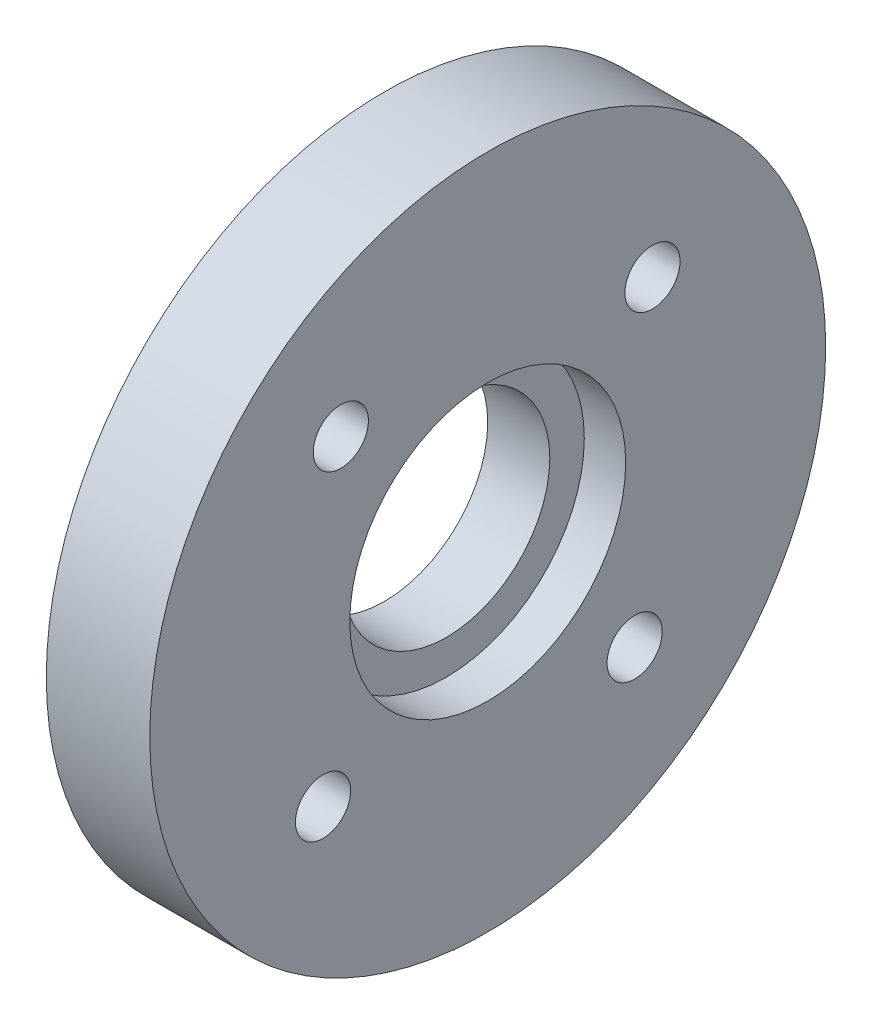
ISO-10303-21;
HEADER;
FILE_DESCRIPTION(('STEP AP214'),'2;1');
FILE_NAME('part.step','',(''),(''),'','','');
FILE_SCHEMA(('AUTOMOTIVE_DESIGN { 1 0 10303 214 1 1 1 1 }'));
ENDSEC;
DATA;
#1=APPLICATION_CONTEXT('core data for automotive mechanical design processes');
#2=APPLICATION_PROTOCOL_DEFINITION('international standard','automotive_design',2000,#1);
#3=PRODUCT_CONTEXT('',#1,'mechanical');
#4=PRODUCT('Part','Part','',(#3));
#5=PRODUCT_RELATED_PRODUCT_CATEGORY('part','',(#4));
#6=PRODUCT_DEFINITION_FORMATION('','',#4);
#7=PRODUCT_DEFINITION_CONTEXT('part definition',#1,'design');
#8=PRODUCT_DEFINITION('design','',#6,#7);
#9=PRODUCT_DEFINITION_SHAPE('','',#8);
#10=(LENGTH_UNIT() NAMED_UNIT(*) SI_UNIT(.MILLI.,.METRE.));
#11=(NAMED_UNIT(*) PLANE_ANGLE_UNIT() SI_UNIT($,.RADIAN.));
#12=(NAMED_UNIT(*) SI_UNIT($,.STERADIAN.) SOLID_ANGLE_UNIT());
#13=UNCERTAINTY_MEASURE_WITH_UNIT(LENGTH_MEASURE(1.E-05),#10,'distance_accuracy_value','');
#14=(GEOMETRIC_REPRESENTATION_CONTEXT(3) GLOBAL_UNCERTAINTY_ASSIGNED_CONTEXT((#13)) GLOBAL_UNIT_ASSIGNED_CONTEXT((#10,
#11,#12)) REPRESENTATION_CONTEXT('',''));
#15=CARTESIAN_POINT('',(0.,0.,0.));
#16=DIRECTION('',(0.,0.,1.));
#17=DIRECTION('',(1.,0.,0.));
#18=AXIS2_PLACEMENT_3D('',#15,#16,#17);
#19=CARTESIAN_POINT('',(0.,15.,0.));
#20=DIRECTION('',(1.,0.,0.));
#21=DIRECTION('',(0.,0.,-1.));
#22=AXIS2_PLACEMENT_3D('',#19,#20,#21);
#23=PLANE('',#22);
#24=CARTESIAN_POINT('',(0.,23.8825487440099,21.2984474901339));
#25=DIRECTION('',(1.,0.,0.));
#26=DIRECTION('',(0.,0.,-1.));
#27=AXIS2_PLACEMENT_3D('',#24,#25,#26);
#28=CIRCLE('',#27,4.);
#29=CARTESIAN_POINT('',(0.,23.8825487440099,17.2984474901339));
#30=VERTEX_POINT('',#29);
#31=EDGE_CURVE('E72',#30,#30,#28,.T.);
#32=ORIENTED_EDGE('',*,*,#31,.T.);
#33=EDGE_LOOP('',(#32));
#34=FACE_BOUND('',#33,.T.);
#35=CARTESIAN_POINT('',(0.,21.2984474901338,-23.88254874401));
#36=DIRECTION('',(1.,0.,0.));
#37=DIRECTION('',(0.,0.,-1.));
#38=AXIS2_PLACEMENT_3D('',#35,#36,#37);
#39=CIRCLE('',#38,4.);
#40=CARTESIAN_POINT('',(0.,21.2984474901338,-27.88254874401));
#41=VERTEX_POINT('',#40);
#42=EDGE_CURVE('E66',#41,#41,#39,.T.);
#43=ORIENTED_EDGE('',*,*,#42,.T.);
#44=EDGE_LOOP('',(#43));
#45=FACE_BOUND('',#44,.T.);
#46=CARTESIAN_POINT('',(0.,-23.88254874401,-21.2984474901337));
#47=DIRECTION('',(1.,0.,0.));
#48=DIRECTION('',(0.,0.,-1.));
#49=AXIS2_PLACEMENT_3D('',#46,#47,#48);
#50=CIRCLE('',#49,4.);
#51=CARTESIAN_POINT('',(0.,-23.88254874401,-25.2984474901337));
#52=VERTEX_POINT('',#51);
#53=EDGE_CURVE('E60',#52,#52,#50,.T.);
#54=ORIENTED_EDGE('',*,*,#53,.T.);
#55=EDGE_LOOP('',(#54));
#56=FACE_BOUND('',#55,.T.);
#57=CARTESIAN_POINT('',(0.,-21.2984474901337,23.8825487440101));
#58=DIRECTION('',(1.,0.,0.));
#59=DIRECTION('',(0.,0.,-1.));
#60=AXIS2_PLACEMENT_3D('',#57,#58,#59);
#61=CIRCLE('',#60,4.);
#62=CARTESIAN_POINT('',(0.,-21.2984474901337,19.8825487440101));
#63=VERTEX_POINT('',#62);
#64=EDGE_CURVE('E54',#63,#63,#61,.T.);
#65=ORIENTED_EDGE('',*,*,#64,.T.);
#66=EDGE_LOOP('',(#65));
#67=FACE_BOUND('',#66,.T.);
#68=CARTESIAN_POINT('',(0.,0.,0.));
#69=DIRECTION('',(-1.,0.,0.));
#70=DIRECTION('',(0.,0.,1.));
#71=AXIS2_PLACEMENT_3D('',#68,#69,#70);
#72=CIRCLE('',#71,15.);
#73=CARTESIAN_POINT('',(0.,0.,15.));
#74=VERTEX_POINT('',#73);
#75=EDGE_CURVE('E51',#74,#74,#72,.T.);
#76=ORIENTED_EDGE('',*,*,#75,.F.);
#77=EDGE_LOOP('',(#76));
#78=FACE_BOUND('',#77,.T.);
#79=CARTESIAN_POINT('',(0.,0.,0.));
#80=DIRECTION('',(-1.,0.,0.));
#81=DIRECTION('',(0.,0.,1.));
#82=AXIS2_PLACEMENT_3D('',#79,#80,#81);
#83=CIRCLE('',#82,49.);
#84=CARTESIAN_POINT('',(0.,0.,49.));
#85=VERTEX_POINT('',#84);
#86=EDGE_CURVE('E10',#85,#85,#83,.T.);
#87=ORIENTED_EDGE('',*,*,#86,.T.);
#88=EDGE_LOOP('',(#87));
#89=FACE_BOUND('',#88,.T.);
#90=ADVANCED_FACE('F29',(#34,#45,#56,#67,#78,#89),#23,.F.);
#91=CARTESIAN_POINT('',(-6.7330201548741,0.,0.));
#92=DIRECTION('',(-1.,0.,0.));
#93=DIRECTION('',(0.,0.,1.));
#94=AXIS2_PLACEMENT_3D('',#91,#92,#93);
#95=CYLINDRICAL_SURFACE('',#94,49.);
#96=ORIENTED_EDGE('',*,*,#86,.F.);
#97=EDGE_LOOP('',(#96));
#98=FACE_BOUND('',#97,.T.);
#99=CARTESIAN_POINT('',(15.,0.,0.));
#100=DIRECTION('',(-1.,0.,0.));
#101=DIRECTION('',(0.,0.,1.));
#102=AXIS2_PLACEMENT_3D('',#99,#100,#101);
#103=CIRCLE('',#102,49.);
#104=CARTESIAN_POINT('',(15.,0.,49.));
#105=VERTEX_POINT('',#104);
#106=EDGE_CURVE('E35',#105,#105,#103,.T.);
#107=ORIENTED_EDGE('',*,*,#106,.T.);
#108=EDGE_LOOP('',(#107));
#109=FACE_BOUND('',#108,.T.);
#110=ADVANCED_FACE('F86',(#98,#109),#95,.T.);
#111=CARTESIAN_POINT('',(15.,49.,0.));
#112=DIRECTION('',(-1.,0.,0.));
#113=DIRECTION('',(0.,0.,1.));
#114=AXIS2_PLACEMENT_3D('',#111,#112,#113);
#115=PLANE('',#114);
#116=CARTESIAN_POINT('',(15.,23.8825487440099,21.2984474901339));
#117=DIRECTION('',(1.,0.,0.));
#118=DIRECTION('',(0.,0.,-1.));
#119=AXIS2_PLACEMENT_3D('',#116,#117,#118);
#120=CIRCLE('',#119,4.);
#121=CARTESIAN_POINT('',(15.,23.8825487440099,17.2984474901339));
#122=VERTEX_POINT('',#121);
#123=EDGE_CURVE('E75',#122,#122,#120,.T.);
#124=ORIENTED_EDGE('',*,*,#123,.F.);
#125=EDGE_LOOP('',(#124));
#126=FACE_BOUND('',#125,.T.);
#127=CARTESIAN_POINT('',(15.,21.2984474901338,-23.88254874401));
#128=DIRECTION('',(1.,0.,0.));
#129=DIRECTION('',(0.,0.,-1.));
#130=AXIS2_PLACEMENT_3D('',#127,#128,#129);
#131=CIRCLE('',#130,4.);
#132=CARTESIAN_POINT('',(15.,21.2984474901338,-27.88254874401));
#133=VERTEX_POINT('',#132);
#134=EDGE_CURVE('E69',#133,#133,#131,.T.);
#135=ORIENTED_EDGE('',*,*,#134,.F.);
#136=EDGE_LOOP('',(#135));
#137=FACE_BOUND('',#136,.T.);
#138=CARTESIAN_POINT('',(15.,-23.88254874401,-21.2984474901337));
#139=DIRECTION('',(1.,0.,0.));
#140=DIRECTION('',(0.,0.,-1.));
#141=AXIS2_PLACEMENT_3D('',#138,#139,#140);
#142=CIRCLE('',#141,4.);
#143=CARTESIAN_POINT('',(15.,-23.88254874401,-25.2984474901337));
#144=VERTEX_POINT('',#143);
#145=EDGE_CURVE('E63',#144,#144,#142,.T.);
#146=ORIENTED_EDGE('',*,*,#145,.F.);
#147=EDGE_LOOP('',(#146));
#148=FACE_BOUND('',#147,.T.);
#149=CARTESIAN_POINT('',(15.,-21.2984474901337,23.8825487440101));
#150=DIRECTION('',(1.,0.,0.));
#151=DIRECTION('',(0.,0.,-1.));
#152=AXIS2_PLACEMENT_3D('',#149,#150,#151);
#153=CIRCLE('',#152,4.);
#154=CARTESIAN_POINT('',(15.,-21.2984474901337,19.8825487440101));
#155=VERTEX_POINT('',#154);
#156=EDGE_CURVE('E57',#155,#155,#153,.T.);
#157=ORIENTED_EDGE('',*,*,#156,.F.);
#158=EDGE_LOOP('',(#157));
#159=FACE_BOUND('',#158,.T.);
#160=ORIENTED_EDGE('',*,*,#106,.F.);
#161=EDGE_LOOP('',(#160));
#162=FACE_BOUND('',#161,.T.);
#163=CARTESIAN_POINT('',(15.,0.,0.));
#164=DIRECTION('',(-1.,0.,0.));
#165=DIRECTION('',(0.,0.,1.));
#166=AXIS2_PLACEMENT_3D('',#163,#164,#165);
#167=CIRCLE('',#166,20.);
#168=CARTESIAN_POINT('',(15.,0.,20.));
#169=VERTEX_POINT('',#168);
#170=EDGE_CURVE('E39',#169,#169,#167,.T.);
#171=ORIENTED_EDGE('',*,*,#170,.T.);
#172=EDGE_LOOP('',(#171));
#173=FACE_BOUND('',#172,.T.);
#174=ADVANCED_FACE('F82',(#126,#137,#148,#159,#162,#173),#115,.F.);
#175=CARTESIAN_POINT('',(-6.7330201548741,0.,0.));
#176=DIRECTION('',(-1.,0.,0.));
#177=DIRECTION('',(0.,0.,1.));
#178=AXIS2_PLACEMENT_3D('',#175,#176,#177);
#179=CYLINDRICAL_SURFACE('',#178,20.);
#180=ORIENTED_EDGE('',*,*,#170,.F.);
#181=EDGE_LOOP('',(#180));
#182=FACE_BOUND('',#181,.T.);
#183=CARTESIAN_POINT('',(9.,0.,0.));
#184=DIRECTION('',(-1.,0.,0.));
#185=DIRECTION('',(0.,0.,1.));
#186=AXIS2_PLACEMENT_3D('',#183,#184,#185);
#187=CIRCLE('',#186,20.);
#188=CARTESIAN_POINT('',(9.,0.,20.));
#189=VERTEX_POINT('',#188);
#190=EDGE_CURVE('E43',#189,#189,#187,.T.);
#191=ORIENTED_EDGE('',*,*,#190,.T.);
#192=EDGE_LOOP('',(#191));
#193=FACE_BOUND('',#192,.T.);
#194=ADVANCED_FACE('F85',(#182,#193),#179,.F.);
#195=CARTESIAN_POINT('',(9.,20.,0.));
#196=DIRECTION('',(-1.,0.,0.));
#197=DIRECTION('',(0.,0.,1.));
#198=AXIS2_PLACEMENT_3D('',#195,#196,#197);
#199=PLANE('',#198);
#200=ORIENTED_EDGE('',*,*,#190,.F.);
#201=EDGE_LOOP('',(#200));
#202=FACE_BOUND('',#201,.T.);
#203=CARTESIAN_POINT('',(9.,0.,0.));
#204=DIRECTION('',(-1.,0.,0.));
#205=DIRECTION('',(0.,0.,1.));
#206=AXIS2_PLACEMENT_3D('',#203,#204,#205);
#207=CIRCLE('',#206,15.);
#208=CARTESIAN_POINT('',(9.,0.,15.));
#209=VERTEX_POINT('',#208);
#210=EDGE_CURVE('E48',#209,#209,#207,.T.);
#211=ORIENTED_EDGE('',*,*,#210,.T.);
#212=EDGE_LOOP('',(#211));
#213=FACE_BOUND('',#212,.T.);
#214=ADVANCED_FACE('F99',(#202,#213),#199,.F.);
#215=CARTESIAN_POINT('',(-6.7330201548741,0.,0.));
#216=DIRECTION('',(-1.,0.,0.));
#217=DIRECTION('',(0.,0.,1.));
#218=AXIS2_PLACEMENT_3D('',#215,#216,#217);
#219=CYLINDRICAL_SURFACE('',#218,15.);
#220=ORIENTED_EDGE('',*,*,#210,.F.);
#221=EDGE_LOOP('',(#220));
#222=FACE_BOUND('',#221,.T.);
#223=ORIENTED_EDGE('',*,*,#75,.T.);
#224=EDGE_LOOP('',(#223));
#225=FACE_BOUND('',#224,.T.);
#226=ADVANCED_FACE('F105',(#222,#225),#219,.F.);
#227=CARTESIAN_POINT('',(15.,-21.2984474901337,23.8825487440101));
#228=DIRECTION('',(1.,0.,0.));
#229=DIRECTION('',(0.,0.,-1.));
#230=AXIS2_PLACEMENT_3D('',#227,#228,#229);
#231=CYLINDRICAL_SURFACE('',#230,4.);
#232=ORIENTED_EDGE('',*,*,#156,.T.);
#233=EDGE_LOOP('',(#232));
#234=FACE_BOUND('',#233,.T.);
#235=ORIENTED_EDGE('',*,*,#64,.F.);
#236=EDGE_LOOP('',(#235));
#237=FACE_BOUND('',#236,.T.);
#238=ADVANCED_FACE('F111',(#234,#237),#231,.F.);
#239=CARTESIAN_POINT('',(15.,-23.88254874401,-21.2984474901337));
#240=DIRECTION('',(1.,0.,0.));
#241=DIRECTION('',(0.,0.,-1.));
#242=AXIS2_PLACEMENT_3D('',#239,#240,#241);
#243=CYLINDRICAL_SURFACE('',#242,4.);
#244=ORIENTED_EDGE('',*,*,#145,.T.);
#245=EDGE_LOOP('',(#244));
#246=FACE_BOUND('',#245,.T.);
#247=ORIENTED_EDGE('',*,*,#53,.F.);
#248=EDGE_LOOP('',(#247));
#249=FACE_BOUND('',#248,.T.);
#250=ADVANCED_FACE('F130',(#246,#249),#243,.F.);
#251=CARTESIAN_POINT('',(15.,21.2984474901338,-23.88254874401));
#252=DIRECTION('',(1.,0.,0.));
#253=DIRECTION('',(0.,0.,-1.));
#254=AXIS2_PLACEMENT_3D('',#251,#252,#253);
#255=CYLINDRICAL_SURFACE('',#254,4.);
#256=ORIENTED_EDGE('',*,*,#134,.T.);
#257=EDGE_LOOP('',(#256));
#258=FACE_BOUND('',#257,.T.);
#259=ORIENTED_EDGE('',*,*,#42,.F.);
#260=EDGE_LOOP('',(#259));
#261=FACE_BOUND('',#260,.T.);
#262=ADVANCED_FACE('F136',(#258,#261),#255,.F.);
#263=CARTESIAN_POINT('',(15.,23.8825487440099,21.2984474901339));
#264=DIRECTION('',(1.,0.,0.));
#265=DIRECTION('',(0.,0.,-1.));
#266=AXIS2_PLACEMENT_3D('',#263,#264,#265);
#267=CYLINDRICAL_SURFACE('',#266,4.);
#268=ORIENTED_EDGE('',*,*,#123,.T.);
#269=EDGE_LOOP('',(#268));
#270=FACE_BOUND('',#269,.T.);
#271=ORIENTED_EDGE('',*,*,#31,.F.);
#272=EDGE_LOOP('',(#271));
#273=FACE_BOUND('',#272,.T.);
#274=ADVANCED_FACE('F79',(#270,#273),#267,.F.);
#275=CLOSED_SHELL('',(#90,#110,#174,#194,#214,#226,#238,#250,#262,#274));
#276=MANIFOLD_SOLID_BREP('B2',#275);
#277=ADVANCED_BREP_SHAPE_REPRESENTATION('',(#18,#276),#14);
#278=SHAPE_DEFINITION_REPRESENTATION(#9,#277);
ENDSEC;
END-ISO-10303-21;
